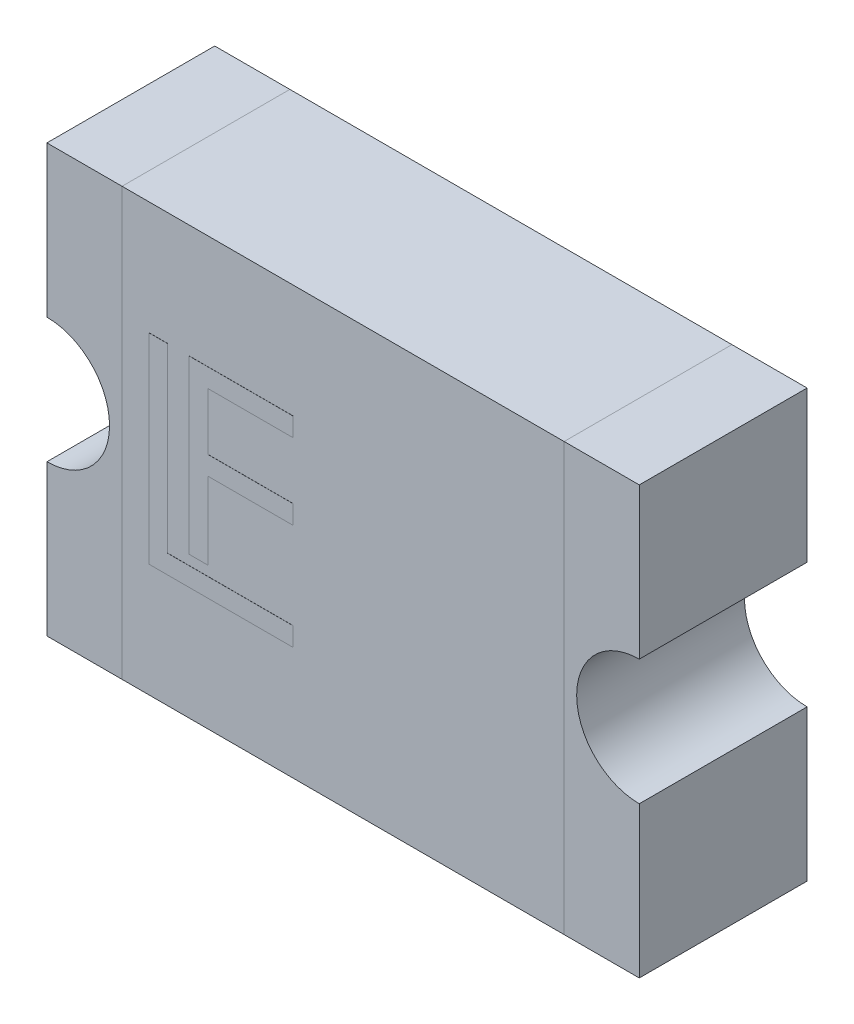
from build123d import *

# Parameters (mm, degrees)
SKETCH1_W        = 3.53
SKETCH1_H        = 3.41
EXTRUDE1_DEPTH   = 1.34
EXTRUDE2_DEPTH   = 1.34
EXTRUDE2_2_DEPTH = 1.34
EXTRUDE3_DEPTH   = 0.001
EXTRUDE3_2_DEPTH = 0.001


with BuildPart() as part:
    # Sketch1 → Extrude1 (new body)
    with BuildSketch(Plane.XY):
        Rectangle(SKETCH1_W, SKETCH1_H)
    extrude(amount=EXTRUDE1_DEPTH)


with BuildPart() as body_2:
    # Sketch2 → Extrude2 (new body)
    with BuildSketch(Plane.XY):
        with BuildLine():
            Line((-2.365, 1.705), (-2.365, 0.5))
            ThreePointArc((-2.365, 0.5), (-1.865, 0), (-2.365, -0.5))
            Line((-2.365, -0.5), (-2.365, -1.705))
            Line((-2.365, -1.705), (-1.765, -1.705))
            Line((-1.765, -1.705), (-1.765, 1.705))
            Line((-1.765, 1.705), (-2.365, 1.705))
        make_face()
    extrude(amount=EXTRUDE2_DEPTH)


with BuildPart() as body_3:
    # Sketch2 → Extrude2 2 (new body)
    with BuildSketch(Plane.XY):
        with BuildLine():
            Line((1.765, 1.705), (2.365, 1.705))
            Line((2.365, 1.705), (2.365, 0.5))
            ThreePointArc((2.365, 0.5), (1.865, 0), (2.365, -0.5))
            Line((2.365, -0.5), (2.365, -1.705))
            Line((2.365, -1.705), (1.765, -1.705))
            Line((1.765, -1.705), (1.765, 1.705))
        make_face()
    extrude(amount=EXTRUDE2_2_DEPTH)


with BuildPart() as body_4:
    # Sketch3 → Extrude3 (new body)
    with BuildSketch(Plane.XY.offset(1.34)):
        Polygon((-1.550268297, 0.8), (-1.550268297, -0.8), (-0.4, -0.8), (-0.4, -0.65), (-1.400268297, -0.65), (-1.400268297, 0.8), align=None)
    extrude(amount=EXTRUDE3_DEPTH)


with BuildPart() as body_5:
    # Sketch3 → Extrude3 2 (new body)
    with BuildSketch(Plane.XY.offset(1.34)):
        Polygon((-1.228413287, 0.8), (-1.228413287, -0.571292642), (-1.078413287, -0.571292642), (-1.078413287, 0.044038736), (-0.4, 0.044038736), (-0.4, 0.194038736), (-1.078413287, 0.194038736), (-1.078413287, 0.65), (-0.4, 0.65), (-0.4, 0.8), align=None)
    extrude(amount=EXTRUDE3_2_DEPTH)


solid = Compound([part.part, body_2.part, body_3.part, body_4.part, body_5.part])
